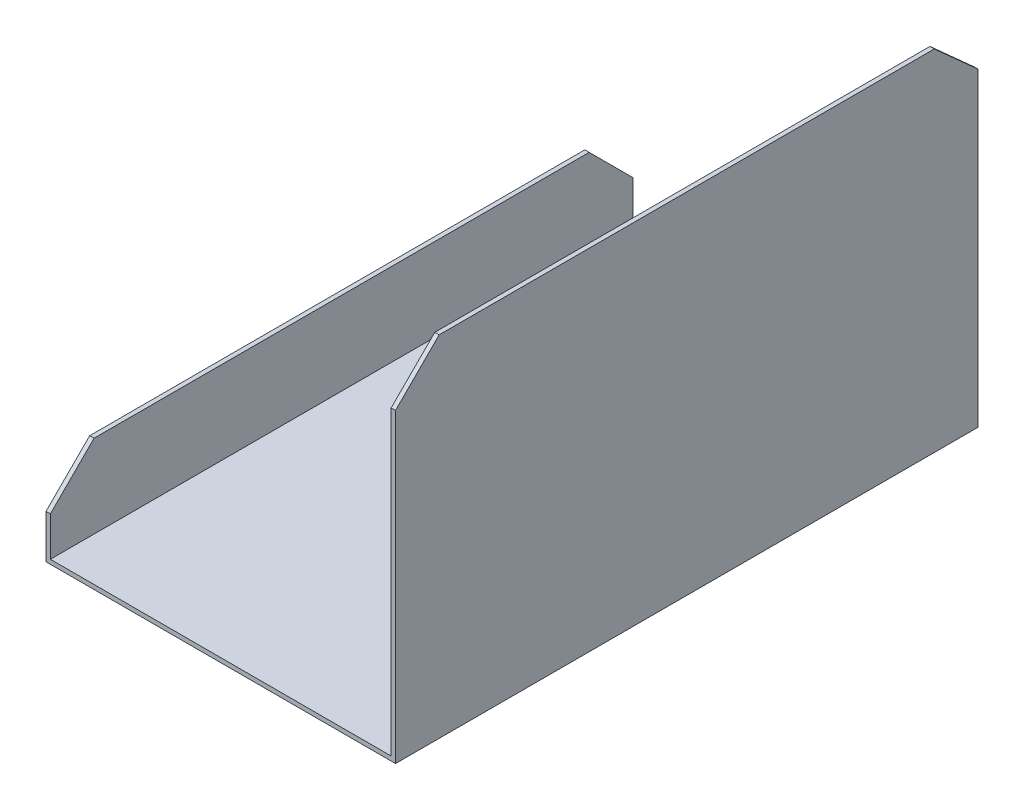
ISO-10303-21;
HEADER;
FILE_DESCRIPTION(('STEP AP214'),'2;1');
FILE_NAME('part.step','',(''),(''),'','','');
FILE_SCHEMA(('AUTOMOTIVE_DESIGN { 1 0 10303 214 1 1 1 1 }'));
ENDSEC;
DATA;
#1=APPLICATION_CONTEXT('core data for automotive mechanical design processes');
#2=APPLICATION_PROTOCOL_DEFINITION('international standard','automotive_design',2000,#1);
#3=PRODUCT_CONTEXT('',#1,'mechanical');
#4=PRODUCT('Part','Part','',(#3));
#5=PRODUCT_RELATED_PRODUCT_CATEGORY('part','',(#4));
#6=PRODUCT_DEFINITION_FORMATION('','',#4);
#7=PRODUCT_DEFINITION_CONTEXT('part definition',#1,'design');
#8=PRODUCT_DEFINITION('design','',#6,#7);
#9=PRODUCT_DEFINITION_SHAPE('','',#8);
#10=(LENGTH_UNIT() NAMED_UNIT(*) SI_UNIT(.MILLI.,.METRE.));
#11=(NAMED_UNIT(*) PLANE_ANGLE_UNIT() SI_UNIT($,.RADIAN.));
#12=(NAMED_UNIT(*) SI_UNIT($,.STERADIAN.) SOLID_ANGLE_UNIT());
#13=UNCERTAINTY_MEASURE_WITH_UNIT(LENGTH_MEASURE(1.E-05),#10,'distance_accuracy_value','');
#14=(GEOMETRIC_REPRESENTATION_CONTEXT(3) GLOBAL_UNCERTAINTY_ASSIGNED_CONTEXT((#13)) GLOBAL_UNIT_ASSIGNED_CONTEXT((#10,
#11,#12)) REPRESENTATION_CONTEXT('',''));
#15=CARTESIAN_POINT('',(0.,0.,0.));
#16=DIRECTION('',(0.,0.,1.));
#17=DIRECTION('',(1.,0.,0.));
#18=AXIS2_PLACEMENT_3D('',#15,#16,#17);
#19=CARTESIAN_POINT('',(118.5,-1.5,200.));
#20=DIRECTION('',(-1.,0.,0.));
#21=DIRECTION('',(0.,-1.,0.));
#22=AXIS2_PLACEMENT_3D('',#19,#20,#21);
#23=PLANE('',#22);
#24=DIRECTION('',(0.,-0.66896473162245,-0.743294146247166));
#25=VECTOR('',#24,1.);
#26=CARTESIAN_POINT('',(118.5,156.78729281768,57.5414364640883));
#27=LINE('',#26,#25);
#28=CARTESIAN_POINT('',(118.5,118.5,15.));
#29=VERTEX_POINT('',#28);
#30=CARTESIAN_POINT('',(118.5,105.,0.));
#31=VERTEX_POINT('',#30);
#32=EDGE_CURVE('E125',#29,#31,#27,.T.);
#33=ORIENTED_EDGE('',*,*,#32,.F.);
#34=DIRECTION('',(0.,0.,-1.));
#35=VECTOR('',#34,1.);
#36=CARTESIAN_POINT('',(118.5,118.5,200.));
#37=LINE('',#36,#35);
#38=CARTESIAN_POINT('',(118.5,118.5,185.));
#39=VERTEX_POINT('',#38);
#40=EDGE_CURVE('E138',#39,#29,#37,.T.);
#41=ORIENTED_EDGE('',*,*,#40,.F.);
#42=DIRECTION('',(0.,0.707106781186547,-0.707106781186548));
#43=VECTOR('',#42,1.);
#44=CARTESIAN_POINT('',(118.5,51.,252.5));
#45=LINE('',#44,#43);
#46=CARTESIAN_POINT('',(118.5,103.5,200.));
#47=VERTEX_POINT('',#46);
#48=EDGE_CURVE('E198',#47,#39,#45,.T.);
#49=ORIENTED_EDGE('',*,*,#48,.F.);
#50=DIRECTION('',(0.,1.,0.));
#51=VECTOR('',#50,1.);
#52=CARTESIAN_POINT('',(118.5,-1.5,200.));
#53=LINE('',#52,#51);
#54=CARTESIAN_POINT('',(118.5,-1.5,200.));
#55=VERTEX_POINT('',#54);
#56=EDGE_CURVE('E215',#55,#47,#53,.T.);
#57=ORIENTED_EDGE('',*,*,#56,.F.);
#58=DIRECTION('',(0.,0.,-1.));
#59=VECTOR('',#58,1.);
#60=CARTESIAN_POINT('',(118.5,-1.5,200.));
#61=LINE('',#60,#59);
#62=CARTESIAN_POINT('',(118.5,-1.5,0.));
#63=VERTEX_POINT('',#62);
#64=EDGE_CURVE('E147',#55,#63,#61,.T.);
#65=ORIENTED_EDGE('',*,*,#64,.T.);
#66=DIRECTION('',(0.,1.,0.));
#67=VECTOR('',#66,1.);
#68=CARTESIAN_POINT('',(118.5,-1.5,0.));
#69=LINE('',#68,#67);
#70=EDGE_CURVE('E142',#63,#31,#69,.T.);
#71=ORIENTED_EDGE('',*,*,#70,.T.);
#72=EDGE_LOOP('',(#33,#41,#49,#57,#65,#71));
#73=FACE_BOUND('',#72,.T.);
#74=ADVANCED_FACE('F30',(#73),#23,.F.);
#75=CARTESIAN_POINT('',(118.5,118.5,200.));
#76=DIRECTION('',(0.,-1.,0.));
#77=DIRECTION('',(0.,0.,-1.));
#78=AXIS2_PLACEMENT_3D('',#75,#76,#77);
#79=PLANE('',#78);
#80=DIRECTION('',(-1.,0.,0.));
#81=VECTOR('',#80,1.);
#82=CARTESIAN_POINT('',(446.3719262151,118.5,15.));
#83=LINE('',#82,#81);
#84=CARTESIAN_POINT('',(117.,118.5,15.));
#85=VERTEX_POINT('',#84);
#86=EDGE_CURVE('E122',#29,#85,#83,.T.);
#87=ORIENTED_EDGE('',*,*,#86,.T.);
#88=DIRECTION('',(0.,0.,-1.));
#89=VECTOR('',#88,1.);
#90=CARTESIAN_POINT('',(117.,118.5,200.));
#91=LINE('',#90,#89);
#92=CARTESIAN_POINT('',(117.,118.5,185.));
#93=VERTEX_POINT('',#92);
#94=EDGE_CURVE('E148',#93,#85,#91,.T.);
#95=ORIENTED_EDGE('',*,*,#94,.F.);
#96=DIRECTION('',(-1.,0.,0.));
#97=VECTOR('',#96,1.);
#98=CARTESIAN_POINT('',(596.3719262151,118.5,185.));
#99=LINE('',#98,#97);
#100=EDGE_CURVE('E143',#39,#93,#99,.T.);
#101=ORIENTED_EDGE('',*,*,#100,.F.);
#102=ORIENTED_EDGE('',*,*,#40,.T.);
#103=EDGE_LOOP('',(#87,#95,#101,#102));
#104=FACE_BOUND('',#103,.T.);
#105=ADVANCED_FACE('F145',(#104),#79,.F.);
#106=CARTESIAN_POINT('',(117.,0.,200.));
#107=DIRECTION('',(1.,0.,0.));
#108=DIRECTION('',(0.,0.,-1.));
#109=AXIS2_PLACEMENT_3D('',#106,#107,#108);
#110=PLANE('',#109);
#111=DIRECTION('',(0.,0.66896473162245,0.743294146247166));
#112=VECTOR('',#111,1.);
#113=CARTESIAN_POINT('',(117.,157.458563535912,58.2872928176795));
#114=LINE('',#113,#112);
#115=CARTESIAN_POINT('',(117.,105.,0.));
#116=VERTEX_POINT('',#115);
#117=EDGE_CURVE('E128',#116,#85,#114,.T.);
#118=ORIENTED_EDGE('',*,*,#117,.F.);
#119=DIRECTION('',(0.,-1.,0.));
#120=VECTOR('',#119,1.);
#121=CARTESIAN_POINT('',(117.,0.,0.));
#122=LINE('',#121,#120);
#123=CARTESIAN_POINT('',(117.,0.,0.));
#124=VERTEX_POINT('',#123);
#125=EDGE_CURVE('E206',#116,#124,#122,.T.);
#126=ORIENTED_EDGE('',*,*,#125,.T.);
#127=DIRECTION('',(0.,0.,-1.));
#128=VECTOR('',#127,1.);
#129=CARTESIAN_POINT('',(117.,0.,200.));
#130=LINE('',#129,#128);
#131=CARTESIAN_POINT('',(117.,0.,200.));
#132=VERTEX_POINT('',#131);
#133=EDGE_CURVE('E152',#132,#124,#130,.T.);
#134=ORIENTED_EDGE('',*,*,#133,.F.);
#135=DIRECTION('',(0.,-1.,0.));
#136=VECTOR('',#135,1.);
#137=CARTESIAN_POINT('',(117.,0.,200.));
#138=LINE('',#137,#136);
#139=CARTESIAN_POINT('',(117.,103.5,200.));
#140=VERTEX_POINT('',#139);
#141=EDGE_CURVE('E217',#140,#132,#138,.T.);
#142=ORIENTED_EDGE('',*,*,#141,.F.);
#143=DIRECTION('',(0.,-0.707106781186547,0.707106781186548));
#144=VECTOR('',#143,1.);
#145=CARTESIAN_POINT('',(117.,51.75,251.75));
#146=LINE('',#145,#144);
#147=EDGE_CURVE('E201',#93,#140,#146,.T.);
#148=ORIENTED_EDGE('',*,*,#147,.F.);
#149=ORIENTED_EDGE('',*,*,#94,.T.);
#150=EDGE_LOOP('',(#118,#126,#134,#142,#148,#149));
#151=FACE_BOUND('',#150,.T.);
#152=ADVANCED_FACE('F232',(#151),#110,.F.);
#153=CARTESIAN_POINT('',(117.,28.5,0.));
#154=DIRECTION('',(0.,0.,-1.));
#155=DIRECTION('',(-1.,0.,0.));
#156=AXIS2_PLACEMENT_3D('',#153,#154,#155);
#157=PLANE('',#156);
#158=DIRECTION('',(0.,-1.,0.));
#159=VECTOR('',#158,1.);
#160=CARTESIAN_POINT('',(-1.5,28.5,0.));
#161=LINE('',#160,#159);
#162=CARTESIAN_POINT('',(-1.5,13.5,0.));
#163=VERTEX_POINT('',#162);
#164=CARTESIAN_POINT('',(-1.5,-1.5,0.));
#165=VERTEX_POINT('',#164);
#166=EDGE_CURVE('E194',#163,#165,#161,.T.);
#167=ORIENTED_EDGE('',*,*,#166,.F.);
#168=DIRECTION('',(1.,0.,0.));
#169=VECTOR('',#168,1.);
#170=CARTESIAN_POINT('',(0.,13.5,0.));
#171=LINE('',#170,#169);
#172=CARTESIAN_POINT('',(0.,13.5,0.));
#173=VERTEX_POINT('',#172);
#174=EDGE_CURVE('E53',#163,#173,#171,.T.);
#175=ORIENTED_EDGE('',*,*,#174,.T.);
#176=DIRECTION('',(0.,1.,0.));
#177=VECTOR('',#176,1.);
#178=CARTESIAN_POINT('',(0.,28.5,0.));
#179=LINE('',#178,#177);
#180=CARTESIAN_POINT('',(0.,0.,0.));
#181=VERTEX_POINT('',#180);
#182=EDGE_CURVE('E181',#181,#173,#179,.T.);
#183=ORIENTED_EDGE('',*,*,#182,.F.);
#184=DIRECTION('',(-1.,0.,0.));
#185=VECTOR('',#184,1.);
#186=CARTESIAN_POINT('',(0.,0.,0.));
#187=LINE('',#186,#185);
#188=EDGE_CURVE('E208',#124,#181,#187,.T.);
#189=ORIENTED_EDGE('',*,*,#188,.F.);
#190=ORIENTED_EDGE('',*,*,#125,.F.);
#191=DIRECTION('',(1.,0.,0.));
#192=VECTOR('',#191,1.);
#193=CARTESIAN_POINT('',(117.,105.,0.));
#194=LINE('',#193,#192);
#195=EDGE_CURVE('E164',#116,#31,#194,.T.);
#196=ORIENTED_EDGE('',*,*,#195,.T.);
#197=ORIENTED_EDGE('',*,*,#70,.F.);
#198=DIRECTION('',(1.,0.,0.));
#199=VECTOR('',#198,1.);
#200=CARTESIAN_POINT('',(-1.5,-1.5,0.));
#201=LINE('',#200,#199);
#202=EDGE_CURVE('E197',#165,#63,#201,.T.);
#203=ORIENTED_EDGE('',*,*,#202,.F.);
#204=EDGE_LOOP('',(#167,#175,#183,#189,#190,#196,#197,#203));
#205=FACE_BOUND('',#204,.T.);
#206=ADVANCED_FACE('F196',(#205),#157,.T.);
#207=CARTESIAN_POINT('',(117.,28.5,200.));
#208=DIRECTION('',(0.,0.,-1.));
#209=DIRECTION('',(-1.,0.,0.));
#210=AXIS2_PLACEMENT_3D('',#207,#208,#209);
#211=PLANE('',#210);
#212=DIRECTION('',(0.,1.,0.));
#213=VECTOR('',#212,1.);
#214=CARTESIAN_POINT('',(0.,28.5,200.));
#215=LINE('',#214,#213);
#216=CARTESIAN_POINT('',(0.,0.,200.));
#217=VERTEX_POINT('',#216);
#218=CARTESIAN_POINT('',(0.,13.4999999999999,200.));
#219=VERTEX_POINT('',#218);
#220=EDGE_CURVE('E188',#217,#219,#215,.T.);
#221=ORIENTED_EDGE('',*,*,#220,.T.);
#222=DIRECTION('',(-1.,0.,0.));
#223=VECTOR('',#222,1.);
#224=CARTESIAN_POINT('',(117.,13.4999999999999,200.));
#225=LINE('',#224,#223);
#226=CARTESIAN_POINT('',(-1.5,13.4999999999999,200.));
#227=VERTEX_POINT('',#226);
#228=EDGE_CURVE('E11',#219,#227,#225,.T.);
#229=ORIENTED_EDGE('',*,*,#228,.T.);
#230=DIRECTION('',(0.,-1.,0.));
#231=VECTOR('',#230,1.);
#232=CARTESIAN_POINT('',(-1.5,28.5,200.));
#233=LINE('',#232,#231);
#234=CARTESIAN_POINT('',(-1.5,-1.5,200.));
#235=VERTEX_POINT('',#234);
#236=EDGE_CURVE('E211',#227,#235,#233,.T.);
#237=ORIENTED_EDGE('',*,*,#236,.T.);
#238=DIRECTION('',(1.,0.,0.));
#239=VECTOR('',#238,1.);
#240=CARTESIAN_POINT('',(-1.5,-1.5,200.));
#241=LINE('',#240,#239);
#242=EDGE_CURVE('E213',#235,#55,#241,.T.);
#243=ORIENTED_EDGE('',*,*,#242,.T.);
#244=ORIENTED_EDGE('',*,*,#56,.T.);
#245=DIRECTION('',(1.,0.,0.));
#246=VECTOR('',#245,1.);
#247=CARTESIAN_POINT('',(117.,103.5,200.));
#248=LINE('',#247,#246);
#249=EDGE_CURVE('E161',#140,#47,#248,.T.);
#250=ORIENTED_EDGE('',*,*,#249,.F.);
#251=ORIENTED_EDGE('',*,*,#141,.T.);
#252=DIRECTION('',(-1.,0.,0.));
#253=VECTOR('',#252,1.);
#254=CARTESIAN_POINT('',(0.,0.,200.));
#255=LINE('',#254,#253);
#256=EDGE_CURVE('E219',#132,#217,#255,.T.);
#257=ORIENTED_EDGE('',*,*,#256,.T.);
#258=EDGE_LOOP('',(#221,#229,#237,#243,#244,#250,#251,#257));
#259=FACE_BOUND('',#258,.T.);
#260=ADVANCED_FACE('F239',(#259),#211,.F.);
#261=CARTESIAN_POINT('',(0.,28.5,200.));
#262=DIRECTION('',(0.,-1.,0.));
#263=DIRECTION('',(0.,0.,-1.));
#264=AXIS2_PLACEMENT_3D('',#261,#262,#263);
#265=PLANE('',#264);
#266=DIRECTION('',(0.,0.,-1.));
#267=VECTOR('',#266,1.);
#268=CARTESIAN_POINT('',(0.,28.5,200.));
#269=LINE('',#268,#267);
#270=CARTESIAN_POINT('',(0.,28.5,185.));
#271=VERTEX_POINT('',#270);
#272=CARTESIAN_POINT('',(0.,28.5,15.0000000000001));
#273=VERTEX_POINT('',#272);
#274=EDGE_CURVE('E179',#271,#273,#269,.T.);
#275=ORIENTED_EDGE('',*,*,#274,.T.);
#276=DIRECTION('',(-1.,0.,0.));
#277=VECTOR('',#276,1.);
#278=CARTESIAN_POINT('',(-1.5,28.5,15.));
#279=LINE('',#278,#277);
#280=CARTESIAN_POINT('',(-1.5,28.5,15.0000000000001));
#281=VERTEX_POINT('',#280);
#282=EDGE_CURVE('E168',#273,#281,#279,.T.);
#283=ORIENTED_EDGE('',*,*,#282,.T.);
#284=DIRECTION('',(0.,0.,-1.));
#285=VECTOR('',#284,1.);
#286=CARTESIAN_POINT('',(-1.5,28.5,200.));
#287=LINE('',#286,#285);
#288=CARTESIAN_POINT('',(-1.5,28.5,185.));
#289=VERTEX_POINT('',#288);
#290=EDGE_CURVE('E158',#289,#281,#287,.T.);
#291=ORIENTED_EDGE('',*,*,#290,.F.);
#292=DIRECTION('',(1.,0.,0.));
#293=VECTOR('',#292,1.);
#294=CARTESIAN_POINT('',(0.,28.5,185.));
#295=LINE('',#294,#293);
#296=EDGE_CURVE('E166',#289,#271,#295,.T.);
#297=ORIENTED_EDGE('',*,*,#296,.T.);
#298=EDGE_LOOP('',(#275,#283,#291,#297));
#299=FACE_BOUND('',#298,.T.);
#300=ADVANCED_FACE('F32',(#299),#265,.F.);
#301=CARTESIAN_POINT('',(-1.5,28.5,200.));
#302=DIRECTION('',(1.,0.,0.));
#303=DIRECTION('',(0.,1.,0.));
#304=AXIS2_PLACEMENT_3D('',#301,#302,#303);
#305=PLANE('',#304);
#306=ORIENTED_EDGE('',*,*,#290,.T.);
#307=DIRECTION('',(0.,-0.707106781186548,-0.707106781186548));
#308=VECTOR('',#307,1.);
#309=CARTESIAN_POINT('',(-1.5,28.5,15.));
#310=LINE('',#309,#308);
#311=EDGE_CURVE('E173',#281,#163,#310,.T.);
#312=ORIENTED_EDGE('',*,*,#311,.T.);
#313=ORIENTED_EDGE('',*,*,#166,.T.);
#314=DIRECTION('',(0.,0.,-1.));
#315=VECTOR('',#314,1.);
#316=CARTESIAN_POINT('',(-1.5,-1.5,200.));
#317=LINE('',#316,#315);
#318=EDGE_CURVE('E150',#235,#165,#317,.T.);
#319=ORIENTED_EDGE('',*,*,#318,.F.);
#320=ORIENTED_EDGE('',*,*,#236,.F.);
#321=DIRECTION('',(0.,-0.707106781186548,0.707106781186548));
#322=VECTOR('',#321,1.);
#323=CARTESIAN_POINT('',(-1.5,13.4999999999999,200.));
#324=LINE('',#323,#322);
#325=EDGE_CURVE('E171',#227,#289,#324,.F.);
#326=ORIENTED_EDGE('',*,*,#325,.T.);
#327=EDGE_LOOP('',(#306,#312,#313,#319,#320,#326));
#328=FACE_BOUND('',#327,.T.);
#329=ADVANCED_FACE('F192',(#328),#305,.F.);
#330=CARTESIAN_POINT('',(-1.5,-1.5,200.));
#331=DIRECTION('',(0.,1.,0.));
#332=DIRECTION('',(0.,0.,1.));
#333=AXIS2_PLACEMENT_3D('',#330,#331,#332);
#334=PLANE('',#333);
#335=ORIENTED_EDGE('',*,*,#202,.T.);
#336=ORIENTED_EDGE('',*,*,#64,.F.);
#337=ORIENTED_EDGE('',*,*,#242,.F.);
#338=ORIENTED_EDGE('',*,*,#318,.T.);
#339=EDGE_LOOP('',(#335,#336,#337,#338));
#340=FACE_BOUND('',#339,.T.);
#341=ADVANCED_FACE('F244',(#340),#334,.F.);
#342=CARTESIAN_POINT('',(0.,0.,200.));
#343=DIRECTION('',(0.,-1.,0.));
#344=DIRECTION('',(0.,0.,-1.));
#345=AXIS2_PLACEMENT_3D('',#342,#343,#344);
#346=PLANE('',#345);
#347=ORIENTED_EDGE('',*,*,#188,.T.);
#348=DIRECTION('',(0.,0.,-1.));
#349=VECTOR('',#348,1.);
#350=CARTESIAN_POINT('',(0.,0.,200.));
#351=LINE('',#350,#349);
#352=EDGE_CURVE('E187',#217,#181,#351,.T.);
#353=ORIENTED_EDGE('',*,*,#352,.F.);
#354=ORIENTED_EDGE('',*,*,#256,.F.);
#355=ORIENTED_EDGE('',*,*,#133,.T.);
#356=EDGE_LOOP('',(#347,#353,#354,#355));
#357=FACE_BOUND('',#356,.T.);
#358=ADVANCED_FACE('F227',(#357),#346,.F.);
#359=CARTESIAN_POINT('',(0.,28.5,200.));
#360=DIRECTION('',(-1.,0.,0.));
#361=DIRECTION('',(0.,-1.,0.));
#362=AXIS2_PLACEMENT_3D('',#359,#360,#361);
#363=PLANE('',#362);
#364=ORIENTED_EDGE('',*,*,#182,.T.);
#365=DIRECTION('',(0.,0.707106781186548,0.707106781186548));
#366=VECTOR('',#365,1.);
#367=CARTESIAN_POINT('',(0.,28.5,15.));
#368=LINE('',#367,#366);
#369=EDGE_CURVE('E38',#173,#273,#368,.T.);
#370=ORIENTED_EDGE('',*,*,#369,.T.);
#371=ORIENTED_EDGE('',*,*,#274,.F.);
#372=DIRECTION('',(0.,0.707106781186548,-0.707106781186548));
#373=VECTOR('',#372,1.);
#374=CARTESIAN_POINT('',(0.,13.4999999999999,200.));
#375=LINE('',#374,#373);
#376=EDGE_CURVE('E45',#271,#219,#375,.F.);
#377=ORIENTED_EDGE('',*,*,#376,.T.);
#378=ORIENTED_EDGE('',*,*,#220,.F.);
#379=ORIENTED_EDGE('',*,*,#352,.T.);
#380=EDGE_LOOP('',(#364,#370,#371,#377,#378,#379));
#381=FACE_BOUND('',#380,.T.);
#382=ADVANCED_FACE('F178',(#381),#363,.F.);
#383=CARTESIAN_POINT('',(596.3719262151,103.5,200.));
#384=DIRECTION('',(0.,0.707106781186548,0.707106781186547));
#385=DIRECTION('',(0.,-0.707106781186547,0.707106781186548));
#386=AXIS2_PLACEMENT_3D('',#383,#384,#385);
#387=PLANE('',#386);
#388=ORIENTED_EDGE('',*,*,#249,.T.);
#389=ORIENTED_EDGE('',*,*,#48,.T.);
#390=ORIENTED_EDGE('',*,*,#100,.T.);
#391=ORIENTED_EDGE('',*,*,#147,.T.);
#392=EDGE_LOOP('',(#388,#389,#390,#391));
#393=FACE_BOUND('',#392,.T.);
#394=ADVANCED_FACE('F237',(#393),#387,.T.);
#395=CARTESIAN_POINT('',(446.3719262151,118.5,15.));
#396=DIRECTION('',(0.,0.743294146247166,-0.66896473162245));
#397=DIRECTION('',(0.,0.66896473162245,0.743294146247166));
#398=AXIS2_PLACEMENT_3D('',#395,#396,#397);
#399=PLANE('',#398);
#400=ORIENTED_EDGE('',*,*,#86,.F.);
#401=ORIENTED_EDGE('',*,*,#32,.T.);
#402=ORIENTED_EDGE('',*,*,#195,.F.);
#403=ORIENTED_EDGE('',*,*,#117,.T.);
#404=EDGE_LOOP('',(#400,#401,#402,#403));
#405=FACE_BOUND('',#404,.T.);
#406=ADVANCED_FACE('F124',(#405),#399,.T.);
#407=CARTESIAN_POINT('',(0.,28.5,15.));
#408=DIRECTION('',(0.,0.707106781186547,-0.707106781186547));
#409=DIRECTION('',(0.,0.707106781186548,0.707106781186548));
#410=AXIS2_PLACEMENT_3D('',#407,#408,#409);
#411=PLANE('',#410);
#412=ORIENTED_EDGE('',*,*,#369,.F.);
#413=ORIENTED_EDGE('',*,*,#174,.F.);
#414=ORIENTED_EDGE('',*,*,#311,.F.);
#415=ORIENTED_EDGE('',*,*,#282,.F.);
#416=EDGE_LOOP('',(#412,#413,#414,#415));
#417=FACE_BOUND('',#416,.T.);
#418=ADVANCED_FACE('F190',(#417),#411,.T.);
#419=CARTESIAN_POINT('',(117.,13.4999999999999,200.));
#420=DIRECTION('',(0.,-0.707106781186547,-0.707106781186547));
#421=DIRECTION('',(0.,0.707106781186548,-0.707106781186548));
#422=AXIS2_PLACEMENT_3D('',#419,#420,#421);
#423=PLANE('',#422);
#424=ORIENTED_EDGE('',*,*,#376,.F.);
#425=ORIENTED_EDGE('',*,*,#296,.F.);
#426=ORIENTED_EDGE('',*,*,#325,.F.);
#427=ORIENTED_EDGE('',*,*,#228,.F.);
#428=EDGE_LOOP('',(#424,#425,#426,#427));
#429=FACE_BOUND('',#428,.T.);
#430=ADVANCED_FACE('F248',(#429),#423,.F.);
#431=CLOSED_SHELL('',(#74,#105,#152,#206,#260,#300,#329,#341,#358,#382,#394,#406,#418,#430));
#432=MANIFOLD_SOLID_BREP('B2',#431);
#433=ADVANCED_BREP_SHAPE_REPRESENTATION('',(#18,#432),#14);
#434=SHAPE_DEFINITION_REPRESENTATION(#9,#433);
ENDSEC;
END-ISO-10303-21;
